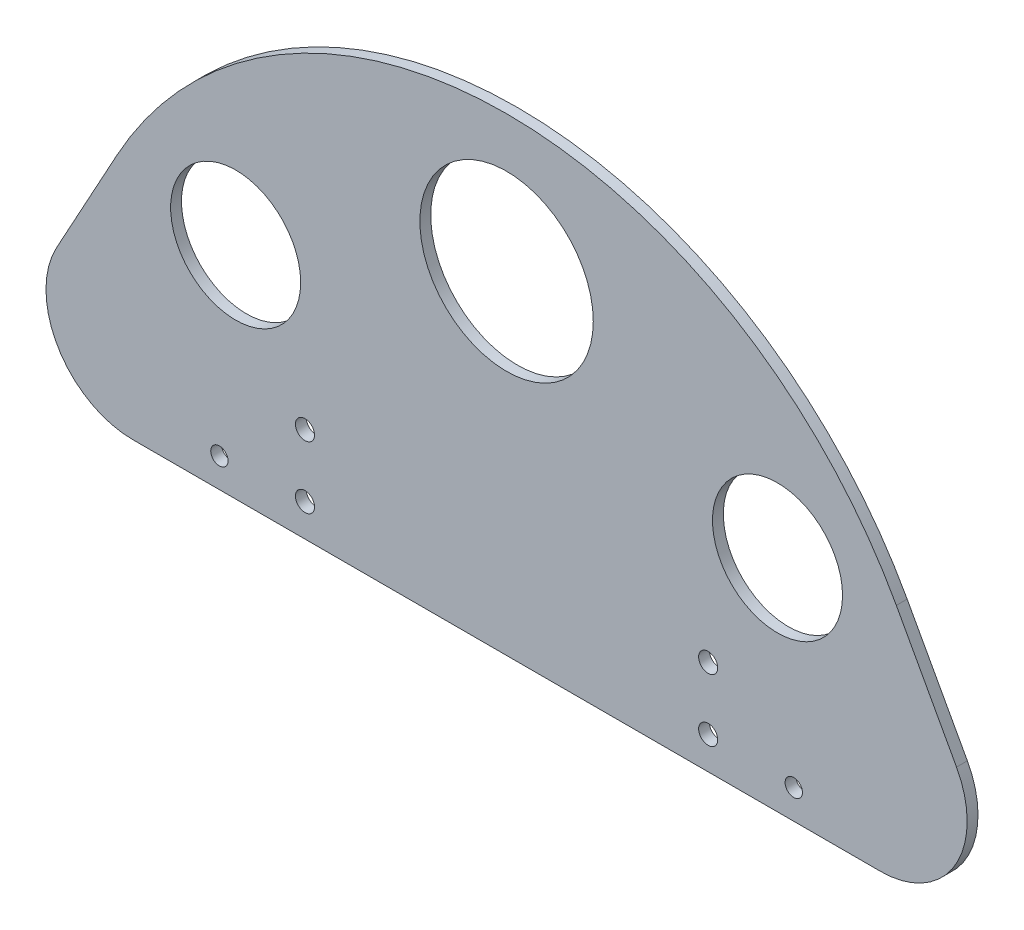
ISO-10303-21;
HEADER;
FILE_DESCRIPTION(('STEP AP214'),'2;1');
FILE_NAME('part.step','',(''),(''),'','','');
FILE_SCHEMA(('AUTOMOTIVE_DESIGN { 1 0 10303 214 1 1 1 1 }'));
ENDSEC;
DATA;
#1=APPLICATION_CONTEXT('core data for automotive mechanical design processes');
#2=APPLICATION_PROTOCOL_DEFINITION('international standard','automotive_design',2000,#1);
#3=PRODUCT_CONTEXT('',#1,'mechanical');
#4=PRODUCT('Part','Part','',(#3));
#5=PRODUCT_RELATED_PRODUCT_CATEGORY('part','',(#4));
#6=PRODUCT_DEFINITION_FORMATION('','',#4);
#7=PRODUCT_DEFINITION_CONTEXT('part definition',#1,'design');
#8=PRODUCT_DEFINITION('design','',#6,#7);
#9=PRODUCT_DEFINITION_SHAPE('','',#8);
#10=(LENGTH_UNIT() NAMED_UNIT(*) SI_UNIT(.MILLI.,.METRE.));
#11=(NAMED_UNIT(*) PLANE_ANGLE_UNIT() SI_UNIT($,.RADIAN.));
#12=(NAMED_UNIT(*) SI_UNIT($,.STERADIAN.) SOLID_ANGLE_UNIT());
#13=UNCERTAINTY_MEASURE_WITH_UNIT(LENGTH_MEASURE(1.E-05),#10,'distance_accuracy_value','');
#14=(GEOMETRIC_REPRESENTATION_CONTEXT(3) GLOBAL_UNCERTAINTY_ASSIGNED_CONTEXT((#13)) GLOBAL_UNIT_ASSIGNED_CONTEXT((#10,
#11,#12)) REPRESENTATION_CONTEXT('',''));
#15=CARTESIAN_POINT('',(0.,0.,0.));
#16=DIRECTION('',(0.,0.,1.));
#17=DIRECTION('',(1.,0.,0.));
#18=AXIS2_PLACEMENT_3D('',#15,#16,#17);
#19=CARTESIAN_POINT('',(0.,-116.84,3.175));
#20=DIRECTION('',(0.,0.,1.));
#21=DIRECTION('',(1.,0.,0.));
#22=AXIS2_PLACEMENT_3D('',#19,#20,#21);
#23=PLANE('',#22);
#24=CARTESIAN_POINT('',(118.11,-112.382917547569,3.175));
#25=DIRECTION('',(0.,0.,1.));
#26=DIRECTION('',(1.,0.,0.));
#27=AXIS2_PLACEMENT_3D('',#24,#25,#26);
#28=CIRCLE('',#27,5.58799999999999);
#29=CARTESIAN_POINT('',(123.698,-112.382917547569,3.175));
#30=VERTEX_POINT('',#29);
#31=EDGE_CURVE('E242',#30,#30,#28,.T.);
#32=ORIENTED_EDGE('',*,*,#31,.F.);
#33=EDGE_LOOP('',(#32));
#34=FACE_BOUND('',#33,.T.);
#35=CARTESIAN_POINT('',(-118.11,-112.382917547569,3.175));
#36=DIRECTION('',(0.,0.,1.));
#37=DIRECTION('',(1.,0.,0.));
#38=AXIS2_PLACEMENT_3D('',#35,#36,#37);
#39=CIRCLE('',#38,5.58799999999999);
#40=CARTESIAN_POINT('',(-112.522,-112.382917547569,3.175));
#41=VERTEX_POINT('',#40);
#42=EDGE_CURVE('E254',#41,#41,#39,.T.);
#43=ORIENTED_EDGE('',*,*,#42,.F.);
#44=EDGE_LOOP('',(#43));
#45=FACE_BOUND('',#44,.T.);
#46=CARTESIAN_POINT('',(158.75,-2.54,3.175));
#47=DIRECTION('',(0.,0.,1.));
#48=DIRECTION('',(1.,0.,0.));
#49=AXIS2_PLACEMENT_3D('',#46,#47,#48);
#50=CIRCLE('',#49,38.1);
#51=CARTESIAN_POINT('',(196.85,-2.54,3.175));
#52=VERTEX_POINT('',#51);
#53=EDGE_CURVE('E266',#52,#52,#50,.T.);
#54=ORIENTED_EDGE('',*,*,#53,.F.);
#55=EDGE_LOOP('',(#54));
#56=FACE_BOUND('',#55,.T.);
#57=CARTESIAN_POINT('',(-158.75,-2.54,3.175));
#58=DIRECTION('',(0.,0.,1.));
#59=DIRECTION('',(1.,0.,0.));
#60=AXIS2_PLACEMENT_3D('',#57,#58,#59);
#61=CIRCLE('',#60,38.1);
#62=CARTESIAN_POINT('',(-120.65,-2.54,3.175));
#63=VERTEX_POINT('',#62);
#64=EDGE_CURVE('E122',#63,#63,#61,.T.);
#65=ORIENTED_EDGE('',*,*,#64,.F.);
#66=EDGE_LOOP('',(#65));
#67=FACE_BOUND('',#66,.T.);
#68=CARTESIAN_POINT('',(0.,-116.84,3.175));
#69=DIRECTION('',(0.,0.,1.));
#70=DIRECTION('',(1.,0.,0.));
#71=AXIS2_PLACEMENT_3D('',#68,#69,#70);
#72=CIRCLE('',#71,260.35);
#73=CARTESIAN_POINT('',(228.367918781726,8.18086294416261,3.175));
#74=VERTEX_POINT('',#73);
#75=CARTESIAN_POINT('',(-228.367918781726,8.18086294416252,3.175));
#76=VERTEX_POINT('',#75);
#77=EDGE_CURVE('E136',#74,#76,#72,.T.);
#78=ORIENTED_EDGE('',*,*,#77,.T.);
#79=DIRECTION('',(-0.480203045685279,-0.877157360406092,0.));
#80=VECTOR('',#79,1.);
#81=CARTESIAN_POINT('',(-263.634593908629,-56.2386028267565,3.175));
#82=LINE('',#81,#80);
#83=CARTESIAN_POINT('',(-263.634593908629,-56.2386028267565,3.175));
#84=VERTEX_POINT('',#83);
#85=EDGE_CURVE('E117',#76,#84,#82,.T.);
#86=ORIENTED_EDGE('',*,*,#85,.T.);
#87=CARTESIAN_POINT('',(-219.075,-80.6329175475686,3.175));
#88=DIRECTION('',(0.,0.,1.));
#89=DIRECTION('',(1.,0.,0.));
#90=AXIS2_PLACEMENT_3D('',#87,#88,#89);
#91=CIRCLE('',#90,50.8);
#92=CARTESIAN_POINT('',(-219.075,-131.432917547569,3.175));
#93=VERTEX_POINT('',#92);
#94=EDGE_CURVE('E139',#84,#93,#91,.T.);
#95=ORIENTED_EDGE('',*,*,#94,.T.);
#96=DIRECTION('',(1.,0.,0.));
#97=VECTOR('',#96,1.);
#98=CARTESIAN_POINT('',(-219.075,-131.432917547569,3.175));
#99=LINE('',#98,#97);
#100=CARTESIAN_POINT('',(219.075,-131.432917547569,3.175));
#101=VERTEX_POINT('',#100);
#102=EDGE_CURVE('E141',#93,#101,#99,.T.);
#103=ORIENTED_EDGE('',*,*,#102,.T.);
#104=CARTESIAN_POINT('',(219.075,-80.6329175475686,3.175));
#105=DIRECTION('',(0.,0.,1.));
#106=DIRECTION('',(1.,0.,0.));
#107=AXIS2_PLACEMENT_3D('',#104,#105,#106);
#108=CIRCLE('',#107,50.8);
#109=CARTESIAN_POINT('',(263.63459390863,-56.2386028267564,3.175));
#110=VERTEX_POINT('',#109);
#111=EDGE_CURVE('E70',#101,#110,#108,.T.);
#112=ORIENTED_EDGE('',*,*,#111,.T.);
#113=DIRECTION('',(-0.480203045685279,0.877157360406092,0.));
#114=VECTOR('',#113,1.);
#115=CARTESIAN_POINT('',(263.63459390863,-56.2386028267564,3.175));
#116=LINE('',#115,#114);
#117=EDGE_CURVE('E65',#110,#74,#116,.T.);
#118=ORIENTED_EDGE('',*,*,#117,.T.);
#119=EDGE_LOOP('',(#78,#86,#95,#103,#112,#118));
#120=FACE_BOUND('',#119,.T.);
#121=CARTESIAN_POINT('',(0.,63.5,3.175));
#122=DIRECTION('',(0.,0.,1.));
#123=DIRECTION('',(1.,0.,0.));
#124=AXIS2_PLACEMENT_3D('',#121,#122,#123);
#125=CIRCLE('',#124,50.8);
#126=CARTESIAN_POINT('',(50.8,63.5,3.175));
#127=VERTEX_POINT('',#126);
#128=EDGE_CURVE('E272',#127,#127,#125,.T.);
#129=ORIENTED_EDGE('',*,*,#128,.F.);
#130=EDGE_LOOP('',(#129));
#131=FACE_BOUND('',#130,.T.);
#132=CARTESIAN_POINT('',(-118.11,-75.8831175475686,3.175));
#133=DIRECTION('',(0.,0.,1.));
#134=DIRECTION('',(1.,0.,0.));
#135=AXIS2_PLACEMENT_3D('',#132,#133,#134);
#136=CIRCLE('',#135,5.58799999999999);
#137=CARTESIAN_POINT('',(-112.522,-75.8831175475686,3.175));
#138=VERTEX_POINT('',#137);
#139=EDGE_CURVE('E260',#138,#138,#136,.T.);
#140=ORIENTED_EDGE('',*,*,#139,.F.);
#141=EDGE_LOOP('',(#140));
#142=FACE_BOUND('',#141,.T.);
#143=CARTESIAN_POINT('',(118.11,-75.8831175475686,3.175));
#144=DIRECTION('',(0.,0.,1.));
#145=DIRECTION('',(1.,0.,0.));
#146=AXIS2_PLACEMENT_3D('',#143,#144,#145);
#147=CIRCLE('',#146,5.58799999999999);
#148=CARTESIAN_POINT('',(123.698,-75.8831175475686,3.175));
#149=VERTEX_POINT('',#148);
#150=EDGE_CURVE('E248',#149,#149,#147,.T.);
#151=ORIENTED_EDGE('',*,*,#150,.F.);
#152=EDGE_LOOP('',(#151));
#153=FACE_BOUND('',#152,.T.);
#154=CARTESIAN_POINT('',(168.275,-114.3,3.175));
#155=DIRECTION('',(0.,0.,1.));
#156=DIRECTION('',(1.,0.,0.));
#157=AXIS2_PLACEMENT_3D('',#154,#155,#156);
#158=CIRCLE('',#157,5.07999999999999);
#159=CARTESIAN_POINT('',(173.355,-114.3,3.175));
#160=VERTEX_POINT('',#159);
#161=EDGE_CURVE('E231',#160,#160,#158,.T.);
#162=ORIENTED_EDGE('',*,*,#161,.F.);
#163=EDGE_LOOP('',(#162));
#164=FACE_BOUND('',#163,.T.);
#165=CARTESIAN_POINT('',(-168.275,-114.3,3.175));
#166=DIRECTION('',(0.,0.,-1.));
#167=DIRECTION('',(-1.,0.,0.));
#168=AXIS2_PLACEMENT_3D('',#165,#166,#167);
#169=CIRCLE('',#168,5.07999999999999);
#170=CARTESIAN_POINT('',(-173.355,-114.3,3.175));
#171=VERTEX_POINT('',#170);
#172=EDGE_CURVE('E228',#171,#171,#169,.T.);
#173=ORIENTED_EDGE('',*,*,#172,.T.);
#174=EDGE_LOOP('',(#173));
#175=FACE_BOUND('',#174,.T.);
#176=ADVANCED_FACE('F50',(#34,#45,#56,#67,#120,#131,#142,#153,#164,#175),#23,.T.);
#177=CARTESIAN_POINT('',(0.,-116.84,-3.175));
#178=DIRECTION('',(0.,0.,1.));
#179=DIRECTION('',(1.,0.,0.));
#180=AXIS2_PLACEMENT_3D('',#177,#178,#179);
#181=PLANE('',#180);
#182=CARTESIAN_POINT('',(118.11,-112.382917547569,-3.175));
#183=DIRECTION('',(0.,0.,1.));
#184=DIRECTION('',(1.,0.,0.));
#185=AXIS2_PLACEMENT_3D('',#182,#183,#184);
#186=CIRCLE('',#185,5.58799999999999);
#187=CARTESIAN_POINT('',(123.698,-112.382917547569,-3.175));
#188=VERTEX_POINT('',#187);
#189=EDGE_CURVE('E239',#188,#188,#186,.T.);
#190=ORIENTED_EDGE('',*,*,#189,.T.);
#191=EDGE_LOOP('',(#190));
#192=FACE_BOUND('',#191,.T.);
#193=CARTESIAN_POINT('',(-118.11,-112.382917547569,-3.175));
#194=DIRECTION('',(0.,0.,1.));
#195=DIRECTION('',(1.,0.,0.));
#196=AXIS2_PLACEMENT_3D('',#193,#194,#195);
#197=CIRCLE('',#196,5.58799999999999);
#198=CARTESIAN_POINT('',(-112.522,-112.382917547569,-3.175));
#199=VERTEX_POINT('',#198);
#200=EDGE_CURVE('E251',#199,#199,#197,.T.);
#201=ORIENTED_EDGE('',*,*,#200,.T.);
#202=EDGE_LOOP('',(#201));
#203=FACE_BOUND('',#202,.T.);
#204=CARTESIAN_POINT('',(158.75,-2.54,-3.175));
#205=DIRECTION('',(0.,0.,1.));
#206=DIRECTION('',(1.,0.,0.));
#207=AXIS2_PLACEMENT_3D('',#204,#205,#206);
#208=CIRCLE('',#207,38.1);
#209=CARTESIAN_POINT('',(196.85,-2.54,-3.175));
#210=VERTEX_POINT('',#209);
#211=EDGE_CURVE('E263',#210,#210,#208,.T.);
#212=ORIENTED_EDGE('',*,*,#211,.T.);
#213=EDGE_LOOP('',(#212));
#214=FACE_BOUND('',#213,.T.);
#215=CARTESIAN_POINT('',(-158.75,-2.54,-3.175));
#216=DIRECTION('',(0.,0.,1.));
#217=DIRECTION('',(1.,0.,0.));
#218=AXIS2_PLACEMENT_3D('',#215,#216,#217);
#219=CIRCLE('',#218,38.1);
#220=CARTESIAN_POINT('',(-120.65,-2.54,-3.175));
#221=VERTEX_POINT('',#220);
#222=EDGE_CURVE('E125',#221,#221,#219,.T.);
#223=ORIENTED_EDGE('',*,*,#222,.T.);
#224=EDGE_LOOP('',(#223));
#225=FACE_BOUND('',#224,.T.);
#226=CARTESIAN_POINT('',(0.,-116.84,-3.175));
#227=DIRECTION('',(0.,0.,1.));
#228=DIRECTION('',(1.,0.,0.));
#229=AXIS2_PLACEMENT_3D('',#226,#227,#228);
#230=CIRCLE('',#229,260.35);
#231=CARTESIAN_POINT('',(228.367918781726,8.18086294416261,-3.175));
#232=VERTEX_POINT('',#231);
#233=CARTESIAN_POINT('',(-228.367918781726,8.18086294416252,-3.175));
#234=VERTEX_POINT('',#233);
#235=EDGE_CURVE('E108',#232,#234,#230,.T.);
#236=ORIENTED_EDGE('',*,*,#235,.F.);
#237=DIRECTION('',(-0.480203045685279,0.877157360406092,0.));
#238=VECTOR('',#237,1.);
#239=CARTESIAN_POINT('',(263.63459390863,-56.2386028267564,-3.175));
#240=LINE('',#239,#238);
#241=CARTESIAN_POINT('',(263.63459390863,-56.2386028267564,-3.175));
#242=VERTEX_POINT('',#241);
#243=EDGE_CURVE('E134',#242,#232,#240,.T.);
#244=ORIENTED_EDGE('',*,*,#243,.F.);
#245=CARTESIAN_POINT('',(219.075,-80.6329175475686,-3.175));
#246=DIRECTION('',(0.,0.,1.));
#247=DIRECTION('',(1.,0.,0.));
#248=AXIS2_PLACEMENT_3D('',#245,#246,#247);
#249=CIRCLE('',#248,50.8);
#250=CARTESIAN_POINT('',(219.075,-131.432917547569,-3.175));
#251=VERTEX_POINT('',#250);
#252=EDGE_CURVE('E132',#251,#242,#249,.T.);
#253=ORIENTED_EDGE('',*,*,#252,.F.);
#254=DIRECTION('',(1.,0.,0.));
#255=VECTOR('',#254,1.);
#256=CARTESIAN_POINT('',(-219.075,-131.432917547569,-3.175));
#257=LINE('',#256,#255);
#258=CARTESIAN_POINT('',(-219.075,-131.432917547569,-3.175));
#259=VERTEX_POINT('',#258);
#260=EDGE_CURVE('E130',#259,#251,#257,.T.);
#261=ORIENTED_EDGE('',*,*,#260,.F.);
#262=CARTESIAN_POINT('',(-219.075,-80.6329175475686,-3.175));
#263=DIRECTION('',(0.,0.,1.));
#264=DIRECTION('',(1.,0.,0.));
#265=AXIS2_PLACEMENT_3D('',#262,#263,#264);
#266=CIRCLE('',#265,50.8);
#267=CARTESIAN_POINT('',(-263.634593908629,-56.2386028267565,-3.175));
#268=VERTEX_POINT('',#267);
#269=EDGE_CURVE('E110',#268,#259,#266,.T.);
#270=ORIENTED_EDGE('',*,*,#269,.F.);
#271=DIRECTION('',(-0.480203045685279,-0.877157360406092,0.));
#272=VECTOR('',#271,1.);
#273=CARTESIAN_POINT('',(-263.634593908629,-56.2386028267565,-3.175));
#274=LINE('',#273,#272);
#275=EDGE_CURVE('E103',#234,#268,#274,.T.);
#276=ORIENTED_EDGE('',*,*,#275,.F.);
#277=EDGE_LOOP('',(#236,#244,#253,#261,#270,#276));
#278=FACE_BOUND('',#277,.T.);
#279=CARTESIAN_POINT('',(0.,63.5,-3.175));
#280=DIRECTION('',(0.,0.,1.));
#281=DIRECTION('',(1.,0.,0.));
#282=AXIS2_PLACEMENT_3D('',#279,#280,#281);
#283=CIRCLE('',#282,50.8);
#284=CARTESIAN_POINT('',(50.8,63.5,-3.175));
#285=VERTEX_POINT('',#284);
#286=EDGE_CURVE('E269',#285,#285,#283,.T.);
#287=ORIENTED_EDGE('',*,*,#286,.T.);
#288=EDGE_LOOP('',(#287));
#289=FACE_BOUND('',#288,.T.);
#290=CARTESIAN_POINT('',(-118.11,-75.8831175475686,-3.175));
#291=DIRECTION('',(0.,0.,1.));
#292=DIRECTION('',(1.,0.,0.));
#293=AXIS2_PLACEMENT_3D('',#290,#291,#292);
#294=CIRCLE('',#293,5.58799999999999);
#295=CARTESIAN_POINT('',(-112.522,-75.8831175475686,-3.175));
#296=VERTEX_POINT('',#295);
#297=EDGE_CURVE('E257',#296,#296,#294,.T.);
#298=ORIENTED_EDGE('',*,*,#297,.T.);
#299=EDGE_LOOP('',(#298));
#300=FACE_BOUND('',#299,.T.);
#301=CARTESIAN_POINT('',(118.11,-75.8831175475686,-3.175));
#302=DIRECTION('',(0.,0.,1.));
#303=DIRECTION('',(1.,0.,0.));
#304=AXIS2_PLACEMENT_3D('',#301,#302,#303);
#305=CIRCLE('',#304,5.58799999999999);
#306=CARTESIAN_POINT('',(123.698,-75.8831175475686,-3.175));
#307=VERTEX_POINT('',#306);
#308=EDGE_CURVE('E245',#307,#307,#305,.T.);
#309=ORIENTED_EDGE('',*,*,#308,.T.);
#310=EDGE_LOOP('',(#309));
#311=FACE_BOUND('',#310,.T.);
#312=CARTESIAN_POINT('',(168.275,-114.3,-3.175));
#313=DIRECTION('',(0.,0.,1.));
#314=DIRECTION('',(1.,0.,0.));
#315=AXIS2_PLACEMENT_3D('',#312,#313,#314);
#316=CIRCLE('',#315,5.07999999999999);
#317=CARTESIAN_POINT('',(173.355,-114.3,-3.175));
#318=VERTEX_POINT('',#317);
#319=EDGE_CURVE('E236',#318,#318,#316,.T.);
#320=ORIENTED_EDGE('',*,*,#319,.T.);
#321=EDGE_LOOP('',(#320));
#322=FACE_BOUND('',#321,.T.);
#323=CARTESIAN_POINT('',(-168.275,-114.3,-3.175));
#324=DIRECTION('',(0.,0.,-1.));
#325=DIRECTION('',(-1.,0.,0.));
#326=AXIS2_PLACEMENT_3D('',#323,#324,#325);
#327=CIRCLE('',#326,5.07999999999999);
#328=CARTESIAN_POINT('',(-173.355,-114.3,-3.175));
#329=VERTEX_POINT('',#328);
#330=EDGE_CURVE('E225',#329,#329,#327,.T.);
#331=ORIENTED_EDGE('',*,*,#330,.F.);
#332=EDGE_LOOP('',(#331));
#333=FACE_BOUND('',#332,.T.);
#334=ADVANCED_FACE('F104',(#192,#203,#214,#225,#278,#289,#300,#311,#322,#333),#181,.F.);
#335=CARTESIAN_POINT('',(0.,-116.84,3.175));
#336=DIRECTION('',(0.,0.,-1.));
#337=DIRECTION('',(-1.,0.,0.));
#338=AXIS2_PLACEMENT_3D('',#335,#336,#337);
#339=CYLINDRICAL_SURFACE('',#338,260.35);
#340=ORIENTED_EDGE('',*,*,#235,.T.);
#341=DIRECTION('',(0.,0.,-1.));
#342=VECTOR('',#341,1.);
#343=CARTESIAN_POINT('',(-228.367918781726,8.18086294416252,3.175));
#344=LINE('',#343,#342);
#345=EDGE_CURVE('E13',#76,#234,#344,.T.);
#346=ORIENTED_EDGE('',*,*,#345,.F.);
#347=ORIENTED_EDGE('',*,*,#77,.F.);
#348=DIRECTION('',(0.,0.,-1.));
#349=VECTOR('',#348,1.);
#350=CARTESIAN_POINT('',(228.367918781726,8.18086294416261,3.175));
#351=LINE('',#350,#349);
#352=EDGE_CURVE('E121',#74,#232,#351,.T.);
#353=ORIENTED_EDGE('',*,*,#352,.T.);
#354=EDGE_LOOP('',(#340,#346,#347,#353));
#355=FACE_BOUND('',#354,.T.);
#356=ADVANCED_FACE('F52',(#355),#339,.T.);
#357=CARTESIAN_POINT('',(-263.634593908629,-56.2386028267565,3.175));
#358=DIRECTION('',(0.877157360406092,-0.480203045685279,0.));
#359=DIRECTION('',(0.480203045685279,0.877157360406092,0.));
#360=AXIS2_PLACEMENT_3D('',#357,#358,#359);
#361=PLANE('',#360);
#362=ORIENTED_EDGE('',*,*,#275,.T.);
#363=DIRECTION('',(0.,0.,-1.));
#364=VECTOR('',#363,1.);
#365=CARTESIAN_POINT('',(-263.634593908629,-56.2386028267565,3.175));
#366=LINE('',#365,#364);
#367=EDGE_CURVE('E58',#84,#268,#366,.T.);
#368=ORIENTED_EDGE('',*,*,#367,.F.);
#369=ORIENTED_EDGE('',*,*,#85,.F.);
#370=ORIENTED_EDGE('',*,*,#345,.T.);
#371=EDGE_LOOP('',(#362,#368,#369,#370));
#372=FACE_BOUND('',#371,.T.);
#373=ADVANCED_FACE('F116',(#372),#361,.F.);
#374=CARTESIAN_POINT('',(-219.075,-80.6329175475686,3.175));
#375=DIRECTION('',(0.,0.,-1.));
#376=DIRECTION('',(-1.,0.,0.));
#377=AXIS2_PLACEMENT_3D('',#374,#375,#376);
#378=CYLINDRICAL_SURFACE('',#377,50.8);
#379=ORIENTED_EDGE('',*,*,#269,.T.);
#380=DIRECTION('',(0.,0.,-1.));
#381=VECTOR('',#380,1.);
#382=CARTESIAN_POINT('',(-219.075,-131.432917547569,3.175));
#383=LINE('',#382,#381);
#384=EDGE_CURVE('E152',#93,#259,#383,.T.);
#385=ORIENTED_EDGE('',*,*,#384,.F.);
#386=ORIENTED_EDGE('',*,*,#94,.F.);
#387=ORIENTED_EDGE('',*,*,#367,.T.);
#388=EDGE_LOOP('',(#379,#385,#386,#387));
#389=FACE_BOUND('',#388,.T.);
#390=ADVANCED_FACE('F156',(#389),#378,.T.);
#391=CARTESIAN_POINT('',(-219.075,-131.432917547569,3.175));
#392=DIRECTION('',(0.,1.,0.));
#393=DIRECTION('',(0.,0.,1.));
#394=AXIS2_PLACEMENT_3D('',#391,#392,#393);
#395=PLANE('',#394);
#396=ORIENTED_EDGE('',*,*,#260,.T.);
#397=DIRECTION('',(0.,0.,-1.));
#398=VECTOR('',#397,1.);
#399=CARTESIAN_POINT('',(219.075,-131.432917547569,3.175));
#400=LINE('',#399,#398);
#401=EDGE_CURVE('E149',#101,#251,#400,.T.);
#402=ORIENTED_EDGE('',*,*,#401,.F.);
#403=ORIENTED_EDGE('',*,*,#102,.F.);
#404=ORIENTED_EDGE('',*,*,#384,.T.);
#405=EDGE_LOOP('',(#396,#402,#403,#404));
#406=FACE_BOUND('',#405,.T.);
#407=ADVANCED_FACE('F162',(#406),#395,.F.);
#408=CARTESIAN_POINT('',(219.075,-80.6329175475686,3.175));
#409=DIRECTION('',(0.,0.,-1.));
#410=DIRECTION('',(-1.,0.,0.));
#411=AXIS2_PLACEMENT_3D('',#408,#409,#410);
#412=CYLINDRICAL_SURFACE('',#411,50.8);
#413=ORIENTED_EDGE('',*,*,#252,.T.);
#414=DIRECTION('',(0.,0.,-1.));
#415=VECTOR('',#414,1.);
#416=CARTESIAN_POINT('',(263.63459390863,-56.2386028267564,3.175));
#417=LINE('',#416,#415);
#418=EDGE_CURVE('E146',#110,#242,#417,.T.);
#419=ORIENTED_EDGE('',*,*,#418,.F.);
#420=ORIENTED_EDGE('',*,*,#111,.F.);
#421=ORIENTED_EDGE('',*,*,#401,.T.);
#422=EDGE_LOOP('',(#413,#419,#420,#421));
#423=FACE_BOUND('',#422,.T.);
#424=ADVANCED_FACE('F165',(#423),#412,.T.);
#425=CARTESIAN_POINT('',(263.63459390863,-56.2386028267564,3.175));
#426=DIRECTION('',(-0.877157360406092,-0.480203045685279,0.));
#427=DIRECTION('',(0.480203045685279,-0.877157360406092,0.));
#428=AXIS2_PLACEMENT_3D('',#425,#426,#427);
#429=PLANE('',#428);
#430=ORIENTED_EDGE('',*,*,#243,.T.);
#431=ORIENTED_EDGE('',*,*,#352,.F.);
#432=ORIENTED_EDGE('',*,*,#117,.F.);
#433=ORIENTED_EDGE('',*,*,#418,.T.);
#434=EDGE_LOOP('',(#430,#431,#432,#433));
#435=FACE_BOUND('',#434,.T.);
#436=ADVANCED_FACE('F167',(#435),#429,.F.);
#437=CARTESIAN_POINT('',(-158.75,-2.54,3.175));
#438=DIRECTION('',(0.,0.,-1.));
#439=DIRECTION('',(-1.,0.,0.));
#440=AXIS2_PLACEMENT_3D('',#437,#438,#439);
#441=CYLINDRICAL_SURFACE('',#440,38.1);
#442=ORIENTED_EDGE('',*,*,#64,.T.);
#443=EDGE_LOOP('',(#442));
#444=FACE_BOUND('',#443,.T.);
#445=ORIENTED_EDGE('',*,*,#222,.F.);
#446=EDGE_LOOP('',(#445));
#447=FACE_BOUND('',#446,.T.);
#448=ADVANCED_FACE('F169',(#444,#447),#441,.F.);
#449=CARTESIAN_POINT('',(0.,63.5,3.175));
#450=DIRECTION('',(0.,0.,-1.));
#451=DIRECTION('',(-1.,0.,0.));
#452=AXIS2_PLACEMENT_3D('',#449,#450,#451);
#453=CYLINDRICAL_SURFACE('',#452,50.8);
#454=ORIENTED_EDGE('',*,*,#128,.T.);
#455=EDGE_LOOP('',(#454));
#456=FACE_BOUND('',#455,.T.);
#457=ORIENTED_EDGE('',*,*,#286,.F.);
#458=EDGE_LOOP('',(#457));
#459=FACE_BOUND('',#458,.T.);
#460=ADVANCED_FACE('F175',(#456,#459),#453,.F.);
#461=CARTESIAN_POINT('',(158.75,-2.54,3.175));
#462=DIRECTION('',(0.,0.,-1.));
#463=DIRECTION('',(-1.,0.,0.));
#464=AXIS2_PLACEMENT_3D('',#461,#462,#463);
#465=CYLINDRICAL_SURFACE('',#464,38.1);
#466=ORIENTED_EDGE('',*,*,#53,.T.);
#467=EDGE_LOOP('',(#466));
#468=FACE_BOUND('',#467,.T.);
#469=ORIENTED_EDGE('',*,*,#211,.F.);
#470=EDGE_LOOP('',(#469));
#471=FACE_BOUND('',#470,.T.);
#472=ADVANCED_FACE('F192',(#468,#471),#465,.F.);
#473=CARTESIAN_POINT('',(-118.11,-75.8831175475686,3.175));
#474=DIRECTION('',(0.,0.,-1.));
#475=DIRECTION('',(-1.,0.,0.));
#476=AXIS2_PLACEMENT_3D('',#473,#474,#475);
#477=CYLINDRICAL_SURFACE('',#476,5.58799999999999);
#478=ORIENTED_EDGE('',*,*,#139,.T.);
#479=EDGE_LOOP('',(#478));
#480=FACE_BOUND('',#479,.T.);
#481=ORIENTED_EDGE('',*,*,#297,.F.);
#482=EDGE_LOOP('',(#481));
#483=FACE_BOUND('',#482,.T.);
#484=ADVANCED_FACE('F196',(#480,#483),#477,.F.);
#485=CARTESIAN_POINT('',(-118.11,-112.382917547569,3.175));
#486=DIRECTION('',(0.,0.,-1.));
#487=DIRECTION('',(-1.,0.,0.));
#488=AXIS2_PLACEMENT_3D('',#485,#486,#487);
#489=CYLINDRICAL_SURFACE('',#488,5.58799999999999);
#490=ORIENTED_EDGE('',*,*,#42,.T.);
#491=EDGE_LOOP('',(#490));
#492=FACE_BOUND('',#491,.T.);
#493=ORIENTED_EDGE('',*,*,#200,.F.);
#494=EDGE_LOOP('',(#493));
#495=FACE_BOUND('',#494,.T.);
#496=ADVANCED_FACE('F200',(#492,#495),#489,.F.);
#497=CARTESIAN_POINT('',(118.11,-75.8831175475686,3.175));
#498=DIRECTION('',(0.,0.,-1.));
#499=DIRECTION('',(-1.,0.,0.));
#500=AXIS2_PLACEMENT_3D('',#497,#498,#499);
#501=CYLINDRICAL_SURFACE('',#500,5.58799999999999);
#502=ORIENTED_EDGE('',*,*,#150,.T.);
#503=EDGE_LOOP('',(#502));
#504=FACE_BOUND('',#503,.T.);
#505=ORIENTED_EDGE('',*,*,#308,.F.);
#506=EDGE_LOOP('',(#505));
#507=FACE_BOUND('',#506,.T.);
#508=ADVANCED_FACE('F204',(#504,#507),#501,.F.);
#509=CARTESIAN_POINT('',(118.11,-112.382917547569,3.175));
#510=DIRECTION('',(0.,0.,-1.));
#511=DIRECTION('',(-1.,0.,0.));
#512=AXIS2_PLACEMENT_3D('',#509,#510,#511);
#513=CYLINDRICAL_SURFACE('',#512,5.58799999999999);
#514=ORIENTED_EDGE('',*,*,#31,.T.);
#515=EDGE_LOOP('',(#514));
#516=FACE_BOUND('',#515,.T.);
#517=ORIENTED_EDGE('',*,*,#189,.F.);
#518=EDGE_LOOP('',(#517));
#519=FACE_BOUND('',#518,.T.);
#520=ADVANCED_FACE('F208',(#516,#519),#513,.F.);
#521=CARTESIAN_POINT('',(168.275,-114.3,-3.175));
#522=DIRECTION('',(0.,0.,1.));
#523=DIRECTION('',(1.,0.,0.));
#524=AXIS2_PLACEMENT_3D('',#521,#522,#523);
#525=CYLINDRICAL_SURFACE('',#524,5.07999999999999);
#526=ORIENTED_EDGE('',*,*,#319,.F.);
#527=EDGE_LOOP('',(#526));
#528=FACE_BOUND('',#527,.T.);
#529=ORIENTED_EDGE('',*,*,#161,.T.);
#530=EDGE_LOOP('',(#529));
#531=FACE_BOUND('',#530,.T.);
#532=ADVANCED_FACE('F212',(#528,#531),#525,.F.);
#533=CARTESIAN_POINT('',(-168.275,-114.3,-3.175));
#534=DIRECTION('',(0.,0.,1.));
#535=DIRECTION('',(1.,0.,0.));
#536=AXIS2_PLACEMENT_3D('',#533,#534,#535);
#537=CYLINDRICAL_SURFACE('',#536,5.07999999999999);
#538=ORIENTED_EDGE('',*,*,#330,.T.);
#539=EDGE_LOOP('',(#538));
#540=FACE_BOUND('',#539,.T.);
#541=ORIENTED_EDGE('',*,*,#172,.F.);
#542=EDGE_LOOP('',(#541));
#543=FACE_BOUND('',#542,.T.);
#544=ADVANCED_FACE('F216',(#540,#543),#537,.F.);
#545=CLOSED_SHELL('',(#176,#334,#356,#373,#390,#407,#424,#436,#448,#460,#472,#484,#496,#508,
#520,#532,#544));
#546=MANIFOLD_SOLID_BREP('B2',#545);
#547=ADVANCED_BREP_SHAPE_REPRESENTATION('',(#18,#546),#14);
#548=SHAPE_DEFINITION_REPRESENTATION(#9,#547);
ENDSEC;
END-ISO-10303-21;
